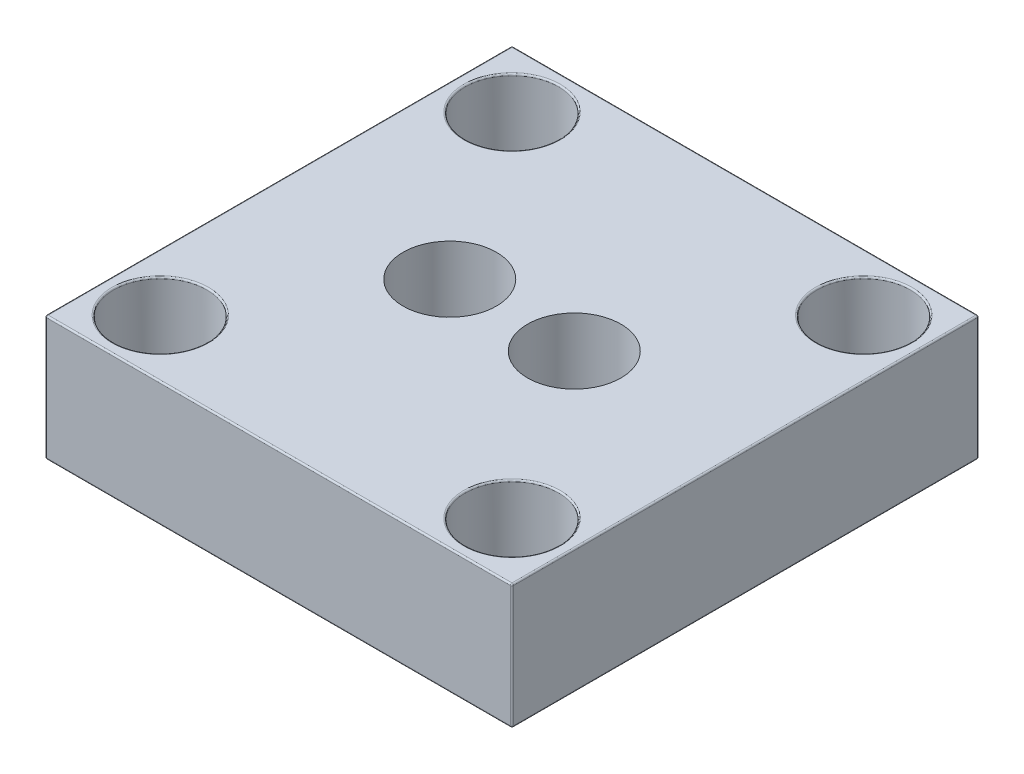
ISO-10303-21;
HEADER;
FILE_DESCRIPTION(('STEP AP214'),'2;1');
FILE_NAME('part.step','',(''),(''),'','','');
FILE_SCHEMA(('AUTOMOTIVE_DESIGN { 1 0 10303 214 1 1 1 1 }'));
ENDSEC;
DATA;
#1=APPLICATION_CONTEXT('core data for automotive mechanical design processes');
#2=APPLICATION_PROTOCOL_DEFINITION('international standard','automotive_design',2000,#1);
#3=PRODUCT_CONTEXT('',#1,'mechanical');
#4=PRODUCT('Part','Part','',(#3));
#5=PRODUCT_RELATED_PRODUCT_CATEGORY('part','',(#4));
#6=PRODUCT_DEFINITION_FORMATION('','',#4);
#7=PRODUCT_DEFINITION_CONTEXT('part definition',#1,'design');
#8=PRODUCT_DEFINITION('design','',#6,#7);
#9=PRODUCT_DEFINITION_SHAPE('','',#8);
#10=(LENGTH_UNIT() NAMED_UNIT(*) SI_UNIT(.MILLI.,.METRE.));
#11=(NAMED_UNIT(*) PLANE_ANGLE_UNIT() SI_UNIT($,.RADIAN.));
#12=(NAMED_UNIT(*) SI_UNIT($,.STERADIAN.) SOLID_ANGLE_UNIT());
#13=UNCERTAINTY_MEASURE_WITH_UNIT(LENGTH_MEASURE(1.E-05),#10,'distance_accuracy_value','');
#14=(GEOMETRIC_REPRESENTATION_CONTEXT(3) GLOBAL_UNCERTAINTY_ASSIGNED_CONTEXT((#13)) GLOBAL_UNIT_ASSIGNED_CONTEXT((#10,
#11,#12)) REPRESENTATION_CONTEXT('',''));
#15=CARTESIAN_POINT('',(0.,0.,0.));
#16=DIRECTION('',(0.,0.,1.));
#17=DIRECTION('',(1.,0.,0.));
#18=AXIS2_PLACEMENT_3D('',#15,#16,#17);
#19=CARTESIAN_POINT('',(47.5,0.,-37.5));
#20=DIRECTION('',(0.,1.,0.));
#21=DIRECTION('',(0.,0.,1.));
#22=AXIS2_PLACEMENT_3D('',#19,#20,#21);
#23=CYLINDRICAL_SURFACE('',#22,4.50000000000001);
#24=CARTESIAN_POINT('',(47.5,0.25,-37.5));
#25=DIRECTION('',(0.,-1.,0.));
#26=DIRECTION('',(0.,0.,-1.));
#27=AXIS2_PLACEMENT_3D('',#24,#25,#26);
#28=CIRCLE('',#27,4.50000000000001);
#29=CARTESIAN_POINT('',(47.5,0.25,-42.));
#30=VERTEX_POINT('',#29);
#31=EDGE_CURVE('E228',#30,#30,#28,.T.);
#32=ORIENTED_EDGE('',*,*,#31,.T.);
#33=EDGE_LOOP('',(#32));
#34=FACE_BOUND('',#33,.T.);
#35=CARTESIAN_POINT('',(47.5,6.,-37.5));
#36=DIRECTION('',(0.,1.,0.));
#37=DIRECTION('',(0.,0.,1.));
#38=AXIS2_PLACEMENT_3D('',#35,#36,#37);
#39=CIRCLE('',#38,4.50000000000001);
#40=CARTESIAN_POINT('',(47.5,6.,-33.));
#41=VERTEX_POINT('',#40);
#42=EDGE_CURVE('E45',#41,#41,#39,.F.);
#43=ORIENTED_EDGE('',*,*,#42,.F.);
#44=EDGE_LOOP('',(#43));
#45=FACE_BOUND('',#44,.T.);
#46=ADVANCED_FACE('F41',(#34,#45),#23,.F.);
#47=CARTESIAN_POINT('',(27.5,0.,-37.5));
#48=DIRECTION('',(0.,1.,0.));
#49=DIRECTION('',(0.,0.,1.));
#50=AXIS2_PLACEMENT_3D('',#47,#48,#49);
#51=CYLINDRICAL_SURFACE('',#50,4.50000000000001);
#52=CARTESIAN_POINT('',(27.5,0.25,-37.5));
#53=DIRECTION('',(0.,-1.,0.));
#54=DIRECTION('',(0.,0.,-1.));
#55=AXIS2_PLACEMENT_3D('',#52,#53,#54);
#56=CIRCLE('',#55,4.50000000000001);
#57=CARTESIAN_POINT('',(27.5,0.25,-42.));
#58=VERTEX_POINT('',#57);
#59=EDGE_CURVE('E212',#58,#58,#56,.T.);
#60=ORIENTED_EDGE('',*,*,#59,.T.);
#61=EDGE_LOOP('',(#60));
#62=FACE_BOUND('',#61,.T.);
#63=CARTESIAN_POINT('',(27.5,6.,-37.5));
#64=DIRECTION('',(0.,1.,0.));
#65=DIRECTION('',(0.,0.,1.));
#66=AXIS2_PLACEMENT_3D('',#63,#64,#65);
#67=CIRCLE('',#66,4.50000000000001);
#68=CARTESIAN_POINT('',(27.5,6.,-33.));
#69=VERTEX_POINT('',#68);
#70=EDGE_CURVE('E327',#69,#69,#67,.F.);
#71=ORIENTED_EDGE('',*,*,#70,.F.);
#72=EDGE_LOOP('',(#71));
#73=FACE_BOUND('',#72,.T.);
#74=ADVANCED_FACE('F453',(#62,#73),#51,.F.);
#75=CARTESIAN_POINT('',(65.75,0.,-9.25));
#76=DIRECTION('',(0.,1.,0.));
#77=DIRECTION('',(0.,0.,1.));
#78=AXIS2_PLACEMENT_3D('',#75,#76,#77);
#79=CYLINDRICAL_SURFACE('',#78,4.5);
#80=CARTESIAN_POINT('',(65.75,0.25,-9.25));
#81=DIRECTION('',(0.,-1.,0.));
#82=DIRECTION('',(0.,0.,-1.));
#83=AXIS2_PLACEMENT_3D('',#80,#81,#82);
#84=CIRCLE('',#83,4.5);
#85=CARTESIAN_POINT('',(65.75,0.25,-13.75));
#86=VERTEX_POINT('',#85);
#87=EDGE_CURVE('E224',#86,#86,#84,.T.);
#88=ORIENTED_EDGE('',*,*,#87,.T.);
#89=EDGE_LOOP('',(#88));
#90=FACE_BOUND('',#89,.T.);
#91=CARTESIAN_POINT('',(65.75,8.,-9.25));
#92=DIRECTION('',(0.,1.,0.));
#93=DIRECTION('',(0.,0.,1.));
#94=AXIS2_PLACEMENT_3D('',#91,#92,#93);
#95=CIRCLE('',#94,4.5);
#96=CARTESIAN_POINT('',(65.75,8.,-4.75));
#97=VERTEX_POINT('',#96);
#98=EDGE_CURVE('E180',#97,#97,#95,.F.);
#99=ORIENTED_EDGE('',*,*,#98,.F.);
#100=EDGE_LOOP('',(#99));
#101=FACE_BOUND('',#100,.T.);
#102=ADVANCED_FACE('F443',(#90,#101),#79,.F.);
#103=CARTESIAN_POINT('',(9.25,0.,-9.25));
#104=DIRECTION('',(0.,1.,0.));
#105=DIRECTION('',(0.,0.,1.));
#106=AXIS2_PLACEMENT_3D('',#103,#104,#105);
#107=CYLINDRICAL_SURFACE('',#106,4.5);
#108=CARTESIAN_POINT('',(9.25,0.25,-9.25));
#109=DIRECTION('',(0.,-1.,0.));
#110=DIRECTION('',(0.,0.,-1.));
#111=AXIS2_PLACEMENT_3D('',#108,#109,#110);
#112=CIRCLE('',#111,4.5);
#113=CARTESIAN_POINT('',(9.25,0.25,-13.75));
#114=VERTEX_POINT('',#113);
#115=EDGE_CURVE('E220',#114,#114,#112,.T.);
#116=ORIENTED_EDGE('',*,*,#115,.T.);
#117=EDGE_LOOP('',(#116));
#118=FACE_BOUND('',#117,.T.);
#119=CARTESIAN_POINT('',(9.25,8.,-9.25));
#120=DIRECTION('',(0.,1.,0.));
#121=DIRECTION('',(0.,0.,1.));
#122=AXIS2_PLACEMENT_3D('',#119,#120,#121);
#123=CIRCLE('',#122,4.5);
#124=CARTESIAN_POINT('',(9.25,8.,-4.75));
#125=VERTEX_POINT('',#124);
#126=EDGE_CURVE('E423',#125,#125,#123,.F.);
#127=ORIENTED_EDGE('',*,*,#126,.F.);
#128=EDGE_LOOP('',(#127));
#129=FACE_BOUND('',#128,.T.);
#130=ADVANCED_FACE('F440',(#118,#129),#107,.F.);
#131=CARTESIAN_POINT('',(9.24999999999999,0.,-65.75));
#132=DIRECTION('',(0.,1.,0.));
#133=DIRECTION('',(0.,0.,1.));
#134=AXIS2_PLACEMENT_3D('',#131,#132,#133);
#135=CYLINDRICAL_SURFACE('',#134,4.50000000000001);
#136=CARTESIAN_POINT('',(9.24999999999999,0.25,-65.75));
#137=DIRECTION('',(0.,-1.,0.));
#138=DIRECTION('',(0.,0.,-1.));
#139=AXIS2_PLACEMENT_3D('',#136,#137,#138);
#140=CIRCLE('',#139,4.50000000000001);
#141=CARTESIAN_POINT('',(9.24999999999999,0.25,-70.25));
#142=VERTEX_POINT('',#141);
#143=EDGE_CURVE('E216',#142,#142,#140,.T.);
#144=ORIENTED_EDGE('',*,*,#143,.T.);
#145=EDGE_LOOP('',(#144));
#146=FACE_BOUND('',#145,.T.);
#147=CARTESIAN_POINT('',(9.24999999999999,8.,-65.75));
#148=DIRECTION('',(0.,1.,0.));
#149=DIRECTION('',(0.,0.,1.));
#150=AXIS2_PLACEMENT_3D('',#147,#148,#149);
#151=CIRCLE('',#150,4.50000000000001);
#152=CARTESIAN_POINT('',(9.24999999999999,8.,-61.25));
#153=VERTEX_POINT('',#152);
#154=EDGE_CURVE('E428',#153,#153,#151,.F.);
#155=ORIENTED_EDGE('',*,*,#154,.F.);
#156=EDGE_LOOP('',(#155));
#157=FACE_BOUND('',#156,.T.);
#158=ADVANCED_FACE('F442',(#146,#157),#135,.F.);
#159=CARTESIAN_POINT('',(65.75,0.,-65.75));
#160=DIRECTION('',(0.,1.,0.));
#161=DIRECTION('',(0.,0.,1.));
#162=AXIS2_PLACEMENT_3D('',#159,#160,#161);
#163=CYLINDRICAL_SURFACE('',#162,4.50000000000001);
#164=CARTESIAN_POINT('',(65.75,0.25,-65.75));
#165=DIRECTION('',(0.,-1.,0.));
#166=DIRECTION('',(0.,0.,-1.));
#167=AXIS2_PLACEMENT_3D('',#164,#165,#166);
#168=CIRCLE('',#167,4.50000000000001);
#169=CARTESIAN_POINT('',(65.75,0.25,-70.25));
#170=VERTEX_POINT('',#169);
#171=EDGE_CURVE('E232',#170,#170,#168,.T.);
#172=ORIENTED_EDGE('',*,*,#171,.T.);
#173=EDGE_LOOP('',(#172));
#174=FACE_BOUND('',#173,.T.);
#175=CARTESIAN_POINT('',(65.75,8.,-65.75));
#176=DIRECTION('',(0.,1.,0.));
#177=DIRECTION('',(0.,0.,1.));
#178=AXIS2_PLACEMENT_3D('',#175,#176,#177);
#179=CIRCLE('',#178,4.50000000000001);
#180=CARTESIAN_POINT('',(65.75,8.,-61.25));
#181=VERTEX_POINT('',#180);
#182=EDGE_CURVE('E171',#181,#181,#179,.F.);
#183=ORIENTED_EDGE('',*,*,#182,.F.);
#184=EDGE_LOOP('',(#183));
#185=FACE_BOUND('',#184,.T.);
#186=ADVANCED_FACE('F450',(#174,#185),#163,.F.);
#187=CARTESIAN_POINT('',(0.,20.,0.));
#188=DIRECTION('',(1.,0.,0.));
#189=DIRECTION('',(0.,0.,-1.));
#190=AXIS2_PLACEMENT_3D('',#187,#188,#189);
#191=PLANE('',#190);
#192=DIRECTION('',(0.,-1.,0.));
#193=VECTOR('',#192,1.);
#194=CARTESIAN_POINT('',(0.,20.,-74.75));
#195=LINE('',#194,#193);
#196=CARTESIAN_POINT('',(0.,19.75,-74.75));
#197=VERTEX_POINT('',#196);
#198=CARTESIAN_POINT('',(0.,0.25,-74.75));
#199=VERTEX_POINT('',#198);
#200=EDGE_CURVE('E242',#197,#199,#195,.T.);
#201=ORIENTED_EDGE('',*,*,#200,.T.);
#202=DIRECTION('',(0.,0.,1.));
#203=VECTOR('',#202,1.);
#204=CARTESIAN_POINT('',(0.,0.25,0.));
#205=LINE('',#204,#203);
#206=CARTESIAN_POINT('',(0.,0.25,-0.25));
#207=VERTEX_POINT('',#206);
#208=EDGE_CURVE('E245',#199,#207,#205,.T.);
#209=ORIENTED_EDGE('',*,*,#208,.T.);
#210=DIRECTION('',(0.,-1.,0.));
#211=VECTOR('',#210,1.);
#212=CARTESIAN_POINT('',(0.,20.,-0.25));
#213=LINE('',#212,#211);
#214=CARTESIAN_POINT('',(0.,19.75,-0.25));
#215=VERTEX_POINT('',#214);
#216=EDGE_CURVE('E239',#207,#215,#213,.F.);
#217=ORIENTED_EDGE('',*,*,#216,.T.);
#218=DIRECTION('',(0.,0.,1.));
#219=VECTOR('',#218,1.);
#220=CARTESIAN_POINT('',(0.,19.75,0.));
#221=LINE('',#220,#219);
#222=EDGE_CURVE('E236',#215,#197,#221,.F.);
#223=ORIENTED_EDGE('',*,*,#222,.T.);
#224=EDGE_LOOP('',(#201,#209,#217,#223));
#225=FACE_BOUND('',#224,.T.);
#226=ADVANCED_FACE('F468',(#225),#191,.F.);
#227=CARTESIAN_POINT('',(0.,20.,0.));
#228=DIRECTION('',(0.,0.,-1.));
#229=DIRECTION('',(-1.,0.,0.));
#230=AXIS2_PLACEMENT_3D('',#227,#228,#229);
#231=PLANE('',#230);
#232=DIRECTION('',(0.,-1.,0.));
#233=VECTOR('',#232,1.);
#234=CARTESIAN_POINT('',(0.25,20.,0.));
#235=LINE('',#234,#233);
#236=CARTESIAN_POINT('',(0.25,19.75,0.));
#237=VERTEX_POINT('',#236);
#238=CARTESIAN_POINT('',(0.25,0.25,0.));
#239=VERTEX_POINT('',#238);
#240=EDGE_CURVE('E279',#237,#239,#235,.T.);
#241=ORIENTED_EDGE('',*,*,#240,.T.);
#242=DIRECTION('',(1.,0.,0.));
#243=VECTOR('',#242,1.);
#244=CARTESIAN_POINT('',(75.,0.25,0.));
#245=LINE('',#244,#243);
#246=CARTESIAN_POINT('',(74.75,0.25,0.));
#247=VERTEX_POINT('',#246);
#248=EDGE_CURVE('E283',#239,#247,#245,.T.);
#249=ORIENTED_EDGE('',*,*,#248,.T.);
#250=DIRECTION('',(0.,-1.,0.));
#251=VECTOR('',#250,1.);
#252=CARTESIAN_POINT('',(74.75,20.,0.));
#253=LINE('',#252,#251);
#254=CARTESIAN_POINT('',(74.75,19.75,0.));
#255=VERTEX_POINT('',#254);
#256=EDGE_CURVE('E276',#247,#255,#253,.F.);
#257=ORIENTED_EDGE('',*,*,#256,.T.);
#258=DIRECTION('',(1.,0.,0.));
#259=VECTOR('',#258,1.);
#260=CARTESIAN_POINT('',(0.,19.75,0.));
#261=LINE('',#260,#259);
#262=EDGE_CURVE('E273',#255,#237,#261,.F.);
#263=ORIENTED_EDGE('',*,*,#262,.T.);
#264=EDGE_LOOP('',(#241,#249,#257,#263));
#265=FACE_BOUND('',#264,.T.);
#266=ADVANCED_FACE('F672',(#265),#231,.F.);
#267=CARTESIAN_POINT('',(75.,20.,0.));
#268=DIRECTION('',(-1.,0.,0.));
#269=DIRECTION('',(0.,0.,1.));
#270=AXIS2_PLACEMENT_3D('',#267,#268,#269);
#271=PLANE('',#270);
#272=DIRECTION('',(0.,0.,-1.));
#273=VECTOR('',#272,1.);
#274=CARTESIAN_POINT('',(75.,0.25,-75.));
#275=LINE('',#274,#273);
#276=CARTESIAN_POINT('',(75.,0.25,-0.25));
#277=VERTEX_POINT('',#276);
#278=CARTESIAN_POINT('',(75.,0.25,-74.75));
#279=VERTEX_POINT('',#278);
#280=EDGE_CURVE('E150',#277,#279,#275,.T.);
#281=ORIENTED_EDGE('',*,*,#280,.T.);
#282=DIRECTION('',(0.,-1.,0.));
#283=VECTOR('',#282,1.);
#284=CARTESIAN_POINT('',(75.,20.,-74.75));
#285=LINE('',#284,#283);
#286=CARTESIAN_POINT('',(75.,19.75,-74.75));
#287=VERTEX_POINT('',#286);
#288=EDGE_CURVE('E269',#279,#287,#285,.F.);
#289=ORIENTED_EDGE('',*,*,#288,.T.);
#290=DIRECTION('',(0.,0.,-1.));
#291=VECTOR('',#290,1.);
#292=CARTESIAN_POINT('',(75.,19.75,0.));
#293=LINE('',#292,#291);
#294=CARTESIAN_POINT('',(75.,19.75,-0.25));
#295=VERTEX_POINT('',#294);
#296=EDGE_CURVE('E261',#287,#295,#293,.F.);
#297=ORIENTED_EDGE('',*,*,#296,.T.);
#298=DIRECTION('',(0.,-1.,0.));
#299=VECTOR('',#298,1.);
#300=CARTESIAN_POINT('',(75.,20.,-0.25));
#301=LINE('',#300,#299);
#302=EDGE_CURVE('E264',#295,#277,#301,.T.);
#303=ORIENTED_EDGE('',*,*,#302,.T.);
#304=EDGE_LOOP('',(#281,#289,#297,#303));
#305=FACE_BOUND('',#304,.T.);
#306=ADVANCED_FACE('F676',(#305),#271,.F.);
#307=CARTESIAN_POINT('',(0.,20.,-75.));
#308=DIRECTION('',(0.,0.,1.));
#309=DIRECTION('',(1.,0.,0.));
#310=AXIS2_PLACEMENT_3D('',#307,#308,#309);
#311=PLANE('',#310);
#312=DIRECTION('',(-1.,0.,0.));
#313=VECTOR('',#312,1.);
#314=CARTESIAN_POINT('',(0.,0.25,-75.));
#315=LINE('',#314,#313);
#316=CARTESIAN_POINT('',(74.75,0.25,-75.));
#317=VERTEX_POINT('',#316);
#318=CARTESIAN_POINT('',(0.25,0.25,-75.));
#319=VERTEX_POINT('',#318);
#320=EDGE_CURVE('E254',#317,#319,#315,.T.);
#321=ORIENTED_EDGE('',*,*,#320,.T.);
#322=DIRECTION('',(0.,-1.,0.));
#323=VECTOR('',#322,1.);
#324=CARTESIAN_POINT('',(0.25,20.,-75.));
#325=LINE('',#324,#323);
#326=CARTESIAN_POINT('',(0.25,19.75,-75.));
#327=VERTEX_POINT('',#326);
#328=EDGE_CURVE('E257',#319,#327,#325,.F.);
#329=ORIENTED_EDGE('',*,*,#328,.T.);
#330=DIRECTION('',(-1.,0.,0.));
#331=VECTOR('',#330,1.);
#332=CARTESIAN_POINT('',(0.,19.75,-75.));
#333=LINE('',#332,#331);
#334=CARTESIAN_POINT('',(74.75,19.75,-75.));
#335=VERTEX_POINT('',#334);
#336=EDGE_CURVE('E249',#327,#335,#333,.F.);
#337=ORIENTED_EDGE('',*,*,#336,.T.);
#338=DIRECTION('',(0.,-1.,0.));
#339=VECTOR('',#338,1.);
#340=CARTESIAN_POINT('',(74.75,20.,-75.));
#341=LINE('',#340,#339);
#342=EDGE_CURVE('E252',#335,#317,#341,.T.);
#343=ORIENTED_EDGE('',*,*,#342,.T.);
#344=EDGE_LOOP('',(#321,#329,#337,#343));
#345=FACE_BOUND('',#344,.T.);
#346=ADVANCED_FACE('F534',(#345),#311,.F.);
#347=CARTESIAN_POINT('',(0.,20.,-75.));
#348=DIRECTION('',(0.,-1.,0.));
#349=DIRECTION('',(0.,0.,-1.));
#350=AXIS2_PLACEMENT_3D('',#347,#348,#349);
#351=PLANE('',#350);
#352=CARTESIAN_POINT('',(47.5,20.,-37.5));
#353=DIRECTION('',(0.,1.,0.));
#354=DIRECTION('',(0.,0.,1.));
#355=AXIS2_PLACEMENT_3D('',#352,#353,#354);
#356=CIRCLE('',#355,7.5);
#357=CARTESIAN_POINT('',(47.5,20.,-30.));
#358=VERTEX_POINT('',#357);
#359=EDGE_CURVE('E413',#358,#358,#356,.T.);
#360=ORIENTED_EDGE('',*,*,#359,.F.);
#361=EDGE_LOOP('',(#360));
#362=FACE_BOUND('',#361,.T.);
#363=CARTESIAN_POINT('',(27.5,20.,-37.5));
#364=DIRECTION('',(0.,1.,0.));
#365=DIRECTION('',(0.,0.,1.));
#366=AXIS2_PLACEMENT_3D('',#363,#364,#365);
#367=CIRCLE('',#366,7.5);
#368=CARTESIAN_POINT('',(27.5,20.,-30.));
#369=VERTEX_POINT('',#368);
#370=EDGE_CURVE('E405',#369,#369,#367,.T.);
#371=ORIENTED_EDGE('',*,*,#370,.F.);
#372=EDGE_LOOP('',(#371));
#373=FACE_BOUND('',#372,.T.);
#374=DIRECTION('',(0.,0.,-1.));
#375=VECTOR('',#374,1.);
#376=CARTESIAN_POINT('',(74.75,20.,-75.));
#377=LINE('',#376,#375);
#378=CARTESIAN_POINT('',(74.75,20.,-0.25));
#379=VERTEX_POINT('',#378);
#380=CARTESIAN_POINT('',(74.75,20.,-74.75));
#381=VERTEX_POINT('',#380);
#382=EDGE_CURVE('E59',#379,#381,#377,.T.);
#383=ORIENTED_EDGE('',*,*,#382,.T.);
#384=DIRECTION('',(-1.,0.,0.));
#385=VECTOR('',#384,1.);
#386=CARTESIAN_POINT('',(0.,20.,-74.75));
#387=LINE('',#386,#385);
#388=CARTESIAN_POINT('',(0.25,20.,-74.75));
#389=VERTEX_POINT('',#388);
#390=EDGE_CURVE('E309',#381,#389,#387,.T.);
#391=ORIENTED_EDGE('',*,*,#390,.T.);
#392=DIRECTION('',(0.,0.,1.));
#393=VECTOR('',#392,1.);
#394=CARTESIAN_POINT('',(0.25,20.,-75.));
#395=LINE('',#394,#393);
#396=CARTESIAN_POINT('',(0.25,20.,-0.25));
#397=VERTEX_POINT('',#396);
#398=EDGE_CURVE('E302',#389,#397,#395,.T.);
#399=ORIENTED_EDGE('',*,*,#398,.T.);
#400=DIRECTION('',(1.,0.,0.));
#401=VECTOR('',#400,1.);
#402=CARTESIAN_POINT('',(0.,20.,-0.25));
#403=LINE('',#402,#401);
#404=EDGE_CURVE('E64',#397,#379,#403,.T.);
#405=ORIENTED_EDGE('',*,*,#404,.T.);
#406=EDGE_LOOP('',(#383,#391,#399,#405));
#407=FACE_BOUND('',#406,.T.);
#408=CARTESIAN_POINT('',(65.75,20.,-65.75));
#409=DIRECTION('',(0.,-1.,0.));
#410=DIRECTION('',(0.,0.,-1.));
#411=AXIS2_PLACEMENT_3D('',#408,#409,#410);
#412=CIRCLE('',#411,7.75000000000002);
#413=CARTESIAN_POINT('',(65.75,20.,-73.5));
#414=VERTEX_POINT('',#413);
#415=EDGE_CURVE('E298',#414,#414,#412,.T.);
#416=ORIENTED_EDGE('',*,*,#415,.T.);
#417=EDGE_LOOP('',(#416));
#418=FACE_BOUND('',#417,.T.);
#419=CARTESIAN_POINT('',(9.24999999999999,20.,-65.75));
#420=DIRECTION('',(0.,-1.,0.));
#421=DIRECTION('',(0.,0.,-1.));
#422=AXIS2_PLACEMENT_3D('',#419,#420,#421);
#423=CIRCLE('',#422,7.75);
#424=CARTESIAN_POINT('',(9.24999999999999,20.,-73.5));
#425=VERTEX_POINT('',#424);
#426=EDGE_CURVE('E294',#425,#425,#423,.T.);
#427=ORIENTED_EDGE('',*,*,#426,.T.);
#428=EDGE_LOOP('',(#427));
#429=FACE_BOUND('',#428,.T.);
#430=CARTESIAN_POINT('',(9.25,20.,-9.25));
#431=DIRECTION('',(0.,-1.,0.));
#432=DIRECTION('',(0.,0.,-1.));
#433=AXIS2_PLACEMENT_3D('',#430,#431,#432);
#434=CIRCLE('',#433,7.75);
#435=CARTESIAN_POINT('',(9.25,20.,-17.));
#436=VERTEX_POINT('',#435);
#437=EDGE_CURVE('E290',#436,#436,#434,.T.);
#438=ORIENTED_EDGE('',*,*,#437,.T.);
#439=EDGE_LOOP('',(#438));
#440=FACE_BOUND('',#439,.T.);
#441=CARTESIAN_POINT('',(65.75,20.,-9.25));
#442=DIRECTION('',(0.,-1.,0.));
#443=DIRECTION('',(0.,0.,-1.));
#444=AXIS2_PLACEMENT_3D('',#441,#442,#443);
#445=CIRCLE('',#444,7.75000000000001);
#446=CARTESIAN_POINT('',(65.75,20.,-17.));
#447=VERTEX_POINT('',#446);
#448=EDGE_CURVE('E286',#447,#447,#445,.T.);
#449=ORIENTED_EDGE('',*,*,#448,.T.);
#450=EDGE_LOOP('',(#449));
#451=FACE_BOUND('',#450,.T.);
#452=ADVANCED_FACE('F531',(#362,#373,#407,#418,#429,#440,#451),#351,.F.);
#453=CARTESIAN_POINT('',(0.,0.,-75.));
#454=DIRECTION('',(0.,-1.,0.));
#455=DIRECTION('',(0.,0.,-1.));
#456=AXIS2_PLACEMENT_3D('',#453,#454,#455);
#457=PLANE('',#456);
#458=CARTESIAN_POINT('',(27.5,0.,-37.5));
#459=DIRECTION('',(0.,-1.,0.));
#460=DIRECTION('',(0.,0.,-1.));
#461=AXIS2_PLACEMENT_3D('',#458,#459,#460);
#462=CIRCLE('',#461,4.75000000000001);
#463=CARTESIAN_POINT('',(27.5,0.,-42.25));
#464=VERTEX_POINT('',#463);
#465=EDGE_CURVE('E208',#464,#464,#462,.F.);
#466=ORIENTED_EDGE('',*,*,#465,.T.);
#467=EDGE_LOOP('',(#466));
#468=FACE_BOUND('',#467,.T.);
#469=CARTESIAN_POINT('',(9.24999999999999,0.,-65.75));
#470=DIRECTION('',(0.,-1.,0.));
#471=DIRECTION('',(0.,0.,-1.));
#472=AXIS2_PLACEMENT_3D('',#469,#470,#471);
#473=CIRCLE('',#472,4.75000000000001);
#474=CARTESIAN_POINT('',(9.24999999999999,0.,-70.5));
#475=VERTEX_POINT('',#474);
#476=EDGE_CURVE('E204',#475,#475,#473,.F.);
#477=ORIENTED_EDGE('',*,*,#476,.T.);
#478=EDGE_LOOP('',(#477));
#479=FACE_BOUND('',#478,.T.);
#480=CARTESIAN_POINT('',(9.25,0.,-9.25));
#481=DIRECTION('',(0.,-1.,0.));
#482=DIRECTION('',(0.,0.,-1.));
#483=AXIS2_PLACEMENT_3D('',#480,#481,#482);
#484=CIRCLE('',#483,4.75);
#485=CARTESIAN_POINT('',(9.25,0.,-14.));
#486=VERTEX_POINT('',#485);
#487=EDGE_CURVE('E200',#486,#486,#484,.F.);
#488=ORIENTED_EDGE('',*,*,#487,.T.);
#489=EDGE_LOOP('',(#488));
#490=FACE_BOUND('',#489,.T.);
#491=CARTESIAN_POINT('',(65.75,0.,-9.25));
#492=DIRECTION('',(0.,-1.,0.));
#493=DIRECTION('',(0.,0.,-1.));
#494=AXIS2_PLACEMENT_3D('',#491,#492,#493);
#495=CIRCLE('',#494,4.75000000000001);
#496=CARTESIAN_POINT('',(65.75,0.,-14.));
#497=VERTEX_POINT('',#496);
#498=EDGE_CURVE('E196',#497,#497,#495,.F.);
#499=ORIENTED_EDGE('',*,*,#498,.T.);
#500=EDGE_LOOP('',(#499));
#501=FACE_BOUND('',#500,.T.);
#502=CARTESIAN_POINT('',(47.5,0.,-37.5));
#503=DIRECTION('',(0.,-1.,0.));
#504=DIRECTION('',(0.,0.,-1.));
#505=AXIS2_PLACEMENT_3D('',#502,#503,#504);
#506=CIRCLE('',#505,4.75000000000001);
#507=CARTESIAN_POINT('',(47.5,0.,-42.25));
#508=VERTEX_POINT('',#507);
#509=EDGE_CURVE('E192',#508,#508,#506,.F.);
#510=ORIENTED_EDGE('',*,*,#509,.T.);
#511=EDGE_LOOP('',(#510));
#512=FACE_BOUND('',#511,.T.);
#513=CARTESIAN_POINT('',(65.75,0.,-65.75));
#514=DIRECTION('',(0.,-1.,0.));
#515=DIRECTION('',(0.,0.,-1.));
#516=AXIS2_PLACEMENT_3D('',#513,#514,#515);
#517=CIRCLE('',#516,4.75000000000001);
#518=CARTESIAN_POINT('',(65.75,0.,-70.5));
#519=VERTEX_POINT('',#518);
#520=EDGE_CURVE('E188',#519,#519,#517,.F.);
#521=ORIENTED_EDGE('',*,*,#520,.T.);
#522=EDGE_LOOP('',(#521));
#523=FACE_BOUND('',#522,.T.);
#524=DIRECTION('',(1.,0.,0.));
#525=VECTOR('',#524,1.);
#526=CARTESIAN_POINT('',(0.,0.,-0.25));
#527=LINE('',#526,#525);
#528=CARTESIAN_POINT('',(74.75,0.,-0.25));
#529=VERTEX_POINT('',#528);
#530=CARTESIAN_POINT('',(0.25,0.,-0.25));
#531=VERTEX_POINT('',#530);
#532=EDGE_CURVE('E136',#529,#531,#527,.F.);
#533=ORIENTED_EDGE('',*,*,#532,.T.);
#534=DIRECTION('',(0.,0.,1.));
#535=VECTOR('',#534,1.);
#536=CARTESIAN_POINT('',(0.25,0.,-75.));
#537=LINE('',#536,#535);
#538=CARTESIAN_POINT('',(0.25,0.,-74.75));
#539=VERTEX_POINT('',#538);
#540=EDGE_CURVE('E185',#531,#539,#537,.F.);
#541=ORIENTED_EDGE('',*,*,#540,.T.);
#542=DIRECTION('',(-1.,0.,0.));
#543=VECTOR('',#542,1.);
#544=CARTESIAN_POINT('',(75.,0.,-74.75));
#545=LINE('',#544,#543);
#546=CARTESIAN_POINT('',(74.75,0.,-74.75));
#547=VERTEX_POINT('',#546);
#548=EDGE_CURVE('E139',#539,#547,#545,.F.);
#549=ORIENTED_EDGE('',*,*,#548,.T.);
#550=DIRECTION('',(0.,0.,-1.));
#551=VECTOR('',#550,1.);
#552=CARTESIAN_POINT('',(74.75,0.,0.));
#553=LINE('',#552,#551);
#554=EDGE_CURVE('E131',#547,#529,#553,.F.);
#555=ORIENTED_EDGE('',*,*,#554,.T.);
#556=EDGE_LOOP('',(#533,#541,#549,#555));
#557=FACE_BOUND('',#556,.T.);
#558=ADVANCED_FACE('F133',(#468,#479,#490,#501,#512,#523,#557),#457,.T.);
#559=CARTESIAN_POINT('',(65.75,8.,-65.75));
#560=DIRECTION('',(0.,1.,0.));
#561=DIRECTION('',(0.,0.,1.));
#562=AXIS2_PLACEMENT_3D('',#559,#560,#561);
#563=PLANE('',#562);
#564=CARTESIAN_POINT('',(65.75,8.,-65.75));
#565=DIRECTION('',(0.,1.,0.));
#566=DIRECTION('',(0.,0.,1.));
#567=AXIS2_PLACEMENT_3D('',#564,#565,#566);
#568=CIRCLE('',#567,7.50000000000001);
#569=CARTESIAN_POINT('',(65.75,8.,-58.25));
#570=VERTEX_POINT('',#569);
#571=EDGE_CURVE('E177',#570,#570,#568,.T.);
#572=ORIENTED_EDGE('',*,*,#571,.T.);
#573=EDGE_LOOP('',(#572));
#574=FACE_BOUND('',#573,.T.);
#575=ORIENTED_EDGE('',*,*,#182,.T.);
#576=EDGE_LOOP('',(#575));
#577=FACE_BOUND('',#576,.T.);
#578=ADVANCED_FACE('F474',(#574,#577),#563,.T.);
#579=CARTESIAN_POINT('',(65.75,8.,-65.75));
#580=DIRECTION('',(0.,1.,0.));
#581=DIRECTION('',(0.,0.,1.));
#582=AXIS2_PLACEMENT_3D('',#579,#580,#581);
#583=CYLINDRICAL_SURFACE('',#582,7.50000000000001);
#584=CARTESIAN_POINT('',(65.75,19.75,-65.75));
#585=DIRECTION('',(0.,-1.,0.));
#586=DIRECTION('',(0.,0.,-1.));
#587=AXIS2_PLACEMENT_3D('',#584,#585,#586);
#588=CIRCLE('',#587,7.50000000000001);
#589=CARTESIAN_POINT('',(65.75,19.75,-73.25));
#590=VERTEX_POINT('',#589);
#591=EDGE_CURVE('E312',#590,#590,#588,.F.);
#592=ORIENTED_EDGE('',*,*,#591,.T.);
#593=EDGE_LOOP('',(#592));
#594=FACE_BOUND('',#593,.T.);
#595=ORIENTED_EDGE('',*,*,#571,.F.);
#596=EDGE_LOOP('',(#595));
#597=FACE_BOUND('',#596,.T.);
#598=ADVANCED_FACE('F470',(#594,#597),#583,.F.);
#599=CARTESIAN_POINT('',(9.24999999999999,8.,-65.75));
#600=DIRECTION('',(0.,1.,0.));
#601=DIRECTION('',(0.,0.,1.));
#602=AXIS2_PLACEMENT_3D('',#599,#600,#601);
#603=PLANE('',#602);
#604=CARTESIAN_POINT('',(9.24999999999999,8.,-65.75));
#605=DIRECTION('',(0.,1.,0.));
#606=DIRECTION('',(0.,0.,1.));
#607=AXIS2_PLACEMENT_3D('',#604,#605,#606);
#608=CIRCLE('',#607,7.5);
#609=CARTESIAN_POINT('',(9.24999999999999,8.,-58.25));
#610=VERTEX_POINT('',#609);
#611=EDGE_CURVE('E424',#610,#610,#608,.T.);
#612=ORIENTED_EDGE('',*,*,#611,.T.);
#613=EDGE_LOOP('',(#612));
#614=FACE_BOUND('',#613,.T.);
#615=ORIENTED_EDGE('',*,*,#154,.T.);
#616=EDGE_LOOP('',(#615));
#617=FACE_BOUND('',#616,.T.);
#618=ADVANCED_FACE('F473',(#614,#617),#603,.T.);
#619=CARTESIAN_POINT('',(9.24999999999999,8.,-65.75));
#620=DIRECTION('',(0.,1.,0.));
#621=DIRECTION('',(0.,0.,1.));
#622=AXIS2_PLACEMENT_3D('',#619,#620,#621);
#623=CYLINDRICAL_SURFACE('',#622,7.5);
#624=CARTESIAN_POINT('',(9.24999999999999,19.75,-65.75));
#625=DIRECTION('',(0.,-1.,0.));
#626=DIRECTION('',(0.,0.,-1.));
#627=AXIS2_PLACEMENT_3D('',#624,#625,#626);
#628=CIRCLE('',#627,7.5);
#629=CARTESIAN_POINT('',(9.24999999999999,19.75,-73.25));
#630=VERTEX_POINT('',#629);
#631=EDGE_CURVE('E316',#630,#630,#628,.F.);
#632=ORIENTED_EDGE('',*,*,#631,.T.);
#633=EDGE_LOOP('',(#632));
#634=FACE_BOUND('',#633,.T.);
#635=ORIENTED_EDGE('',*,*,#611,.F.);
#636=EDGE_LOOP('',(#635));
#637=FACE_BOUND('',#636,.T.);
#638=ADVANCED_FACE('F479',(#634,#637),#623,.F.);
#639=CARTESIAN_POINT('',(9.25,8.,-9.25));
#640=DIRECTION('',(0.,1.,0.));
#641=DIRECTION('',(0.,0.,1.));
#642=AXIS2_PLACEMENT_3D('',#639,#640,#641);
#643=PLANE('',#642);
#644=CARTESIAN_POINT('',(9.25,8.,-9.25));
#645=DIRECTION('',(0.,1.,0.));
#646=DIRECTION('',(0.,0.,1.));
#647=AXIS2_PLACEMENT_3D('',#644,#645,#646);
#648=CIRCLE('',#647,7.5);
#649=CARTESIAN_POINT('',(9.25,8.,-1.75));
#650=VERTEX_POINT('',#649);
#651=EDGE_CURVE('E419',#650,#650,#648,.T.);
#652=ORIENTED_EDGE('',*,*,#651,.T.);
#653=EDGE_LOOP('',(#652));
#654=FACE_BOUND('',#653,.T.);
#655=ORIENTED_EDGE('',*,*,#126,.T.);
#656=EDGE_LOOP('',(#655));
#657=FACE_BOUND('',#656,.T.);
#658=ADVANCED_FACE('F438',(#654,#657),#643,.T.);
#659=CARTESIAN_POINT('',(9.25,8.,-9.25));
#660=DIRECTION('',(0.,1.,0.));
#661=DIRECTION('',(0.,0.,1.));
#662=AXIS2_PLACEMENT_3D('',#659,#660,#661);
#663=CYLINDRICAL_SURFACE('',#662,7.5);
#664=CARTESIAN_POINT('',(9.25,19.75,-9.25));
#665=DIRECTION('',(0.,-1.,0.));
#666=DIRECTION('',(0.,0.,-1.));
#667=AXIS2_PLACEMENT_3D('',#664,#665,#666);
#668=CIRCLE('',#667,7.5);
#669=CARTESIAN_POINT('',(9.25,19.75,-16.75));
#670=VERTEX_POINT('',#669);
#671=EDGE_CURVE('E51',#670,#670,#668,.F.);
#672=ORIENTED_EDGE('',*,*,#671,.T.);
#673=EDGE_LOOP('',(#672));
#674=FACE_BOUND('',#673,.T.);
#675=ORIENTED_EDGE('',*,*,#651,.F.);
#676=EDGE_LOOP('',(#675));
#677=FACE_BOUND('',#676,.T.);
#678=ADVANCED_FACE('F486',(#674,#677),#663,.F.);
#679=CARTESIAN_POINT('',(65.75,8.,-9.25));
#680=DIRECTION('',(0.,1.,0.));
#681=DIRECTION('',(0.,0.,1.));
#682=AXIS2_PLACEMENT_3D('',#679,#680,#681);
#683=PLANE('',#682);
#684=CARTESIAN_POINT('',(65.75,8.,-9.25));
#685=DIRECTION('',(0.,1.,0.));
#686=DIRECTION('',(0.,0.,1.));
#687=AXIS2_PLACEMENT_3D('',#684,#685,#686);
#688=CIRCLE('',#687,7.50000000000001);
#689=CARTESIAN_POINT('',(65.75,8.,-1.74999999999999));
#690=VERTEX_POINT('',#689);
#691=EDGE_CURVE('E397',#690,#690,#688,.T.);
#692=ORIENTED_EDGE('',*,*,#691,.T.);
#693=EDGE_LOOP('',(#692));
#694=FACE_BOUND('',#693,.T.);
#695=ORIENTED_EDGE('',*,*,#98,.T.);
#696=EDGE_LOOP('',(#695));
#697=FACE_BOUND('',#696,.T.);
#698=ADVANCED_FACE('F489',(#694,#697),#683,.T.);
#699=CARTESIAN_POINT('',(65.75,8.,-9.25));
#700=DIRECTION('',(0.,1.,0.));
#701=DIRECTION('',(0.,0.,1.));
#702=AXIS2_PLACEMENT_3D('',#699,#700,#701);
#703=CYLINDRICAL_SURFACE('',#702,7.50000000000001);
#704=CARTESIAN_POINT('',(65.75,19.75,-9.25));
#705=DIRECTION('',(0.,-1.,0.));
#706=DIRECTION('',(0.,0.,-1.));
#707=AXIS2_PLACEMENT_3D('',#704,#705,#706);
#708=CIRCLE('',#707,7.50000000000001);
#709=CARTESIAN_POINT('',(65.75,19.75,-16.75));
#710=VERTEX_POINT('',#709);
#711=EDGE_CURVE('E11',#710,#710,#708,.F.);
#712=ORIENTED_EDGE('',*,*,#711,.T.);
#713=EDGE_LOOP('',(#712));
#714=FACE_BOUND('',#713,.T.);
#715=ORIENTED_EDGE('',*,*,#691,.F.);
#716=EDGE_LOOP('',(#715));
#717=FACE_BOUND('',#716,.T.);
#718=ADVANCED_FACE('F494',(#714,#717),#703,.F.);
#719=CARTESIAN_POINT('',(27.5,0.25,-37.5));
#720=DIRECTION('',(0.,-1.,0.));
#721=DIRECTION('',(0.,0.,-1.));
#722=AXIS2_PLACEMENT_3D('',#719,#720,#721);
#723=TOROIDAL_SURFACE('',#722,4.75000000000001,0.25);
#724=ORIENTED_EDGE('',*,*,#59,.F.);
#725=EDGE_LOOP('',(#724));
#726=FACE_BOUND('',#725,.T.);
#727=ORIENTED_EDGE('',*,*,#465,.F.);
#728=EDGE_LOOP('',(#727));
#729=FACE_BOUND('',#728,.T.);
#730=ADVANCED_FACE('F497',(#726,#729),#723,.T.);
#731=CARTESIAN_POINT('',(9.24999999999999,0.25,-65.75));
#732=DIRECTION('',(0.,-1.,0.));
#733=DIRECTION('',(0.,0.,-1.));
#734=AXIS2_PLACEMENT_3D('',#731,#732,#733);
#735=TOROIDAL_SURFACE('',#734,4.75000000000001,0.25);
#736=ORIENTED_EDGE('',*,*,#143,.F.);
#737=EDGE_LOOP('',(#736));
#738=FACE_BOUND('',#737,.T.);
#739=ORIENTED_EDGE('',*,*,#476,.F.);
#740=EDGE_LOOP('',(#739));
#741=FACE_BOUND('',#740,.T.);
#742=ADVANCED_FACE('F662',(#738,#741),#735,.T.);
#743=CARTESIAN_POINT('',(9.25,0.25,-9.25));
#744=DIRECTION('',(0.,-1.,0.));
#745=DIRECTION('',(0.,0.,-1.));
#746=AXIS2_PLACEMENT_3D('',#743,#744,#745);
#747=TOROIDAL_SURFACE('',#746,4.75,0.25);
#748=ORIENTED_EDGE('',*,*,#115,.F.);
#749=EDGE_LOOP('',(#748));
#750=FACE_BOUND('',#749,.T.);
#751=ORIENTED_EDGE('',*,*,#487,.F.);
#752=EDGE_LOOP('',(#751));
#753=FACE_BOUND('',#752,.T.);
#754=ADVANCED_FACE('F658',(#750,#753),#747,.T.);
#755=CARTESIAN_POINT('',(65.75,0.25,-9.25));
#756=DIRECTION('',(0.,-1.,0.));
#757=DIRECTION('',(0.,0.,-1.));
#758=AXIS2_PLACEMENT_3D('',#755,#756,#757);
#759=TOROIDAL_SURFACE('',#758,4.75000000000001,0.25);
#760=ORIENTED_EDGE('',*,*,#87,.F.);
#761=EDGE_LOOP('',(#760));
#762=FACE_BOUND('',#761,.T.);
#763=ORIENTED_EDGE('',*,*,#498,.F.);
#764=EDGE_LOOP('',(#763));
#765=FACE_BOUND('',#764,.T.);
#766=ADVANCED_FACE('F654',(#762,#765),#759,.T.);
#767=CARTESIAN_POINT('',(47.5,0.25,-37.5));
#768=DIRECTION('',(0.,-1.,0.));
#769=DIRECTION('',(0.,0.,-1.));
#770=AXIS2_PLACEMENT_3D('',#767,#768,#769);
#771=TOROIDAL_SURFACE('',#770,4.75000000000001,0.25);
#772=ORIENTED_EDGE('',*,*,#31,.F.);
#773=EDGE_LOOP('',(#772));
#774=FACE_BOUND('',#773,.T.);
#775=ORIENTED_EDGE('',*,*,#509,.F.);
#776=EDGE_LOOP('',(#775));
#777=FACE_BOUND('',#776,.T.);
#778=ADVANCED_FACE('F650',(#774,#777),#771,.T.);
#779=CARTESIAN_POINT('',(65.75,0.25,-65.75));
#780=DIRECTION('',(0.,-1.,0.));
#781=DIRECTION('',(0.,0.,-1.));
#782=AXIS2_PLACEMENT_3D('',#779,#780,#781);
#783=TOROIDAL_SURFACE('',#782,4.75000000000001,0.25);
#784=ORIENTED_EDGE('',*,*,#171,.F.);
#785=EDGE_LOOP('',(#784));
#786=FACE_BOUND('',#785,.T.);
#787=ORIENTED_EDGE('',*,*,#520,.F.);
#788=EDGE_LOOP('',(#787));
#789=FACE_BOUND('',#788,.T.);
#790=ADVANCED_FACE('F578',(#786,#789),#783,.T.);
#791=CARTESIAN_POINT('',(74.75,19.75,-75.));
#792=DIRECTION('',(0.,0.,-1.));
#793=DIRECTION('',(-1.,0.,0.));
#794=AXIS2_PLACEMENT_3D('',#791,#792,#793);
#795=CYLINDRICAL_SURFACE('',#794,0.25);
#796=CARTESIAN_POINT('',(74.75,19.75,-74.75));
#797=DIRECTION('',(0.,0.,-1.));
#798=DIRECTION('',(-1.,0.,0.));
#799=AXIS2_PLACEMENT_3D('',#796,#797,#798);
#800=CIRCLE('',#799,0.25);
#801=EDGE_CURVE('E394',#381,#287,#800,.T.);
#802=ORIENTED_EDGE('',*,*,#801,.F.);
#803=ORIENTED_EDGE('',*,*,#382,.F.);
#804=CARTESIAN_POINT('',(74.75,19.75,-0.25));
#805=DIRECTION('',(0.,0.,1.));
#806=DIRECTION('',(0.,-1.,0.));
#807=AXIS2_PLACEMENT_3D('',#804,#805,#806);
#808=CIRCLE('',#807,0.25);
#809=EDGE_CURVE('E390',#295,#379,#808,.T.);
#810=ORIENTED_EDGE('',*,*,#809,.F.);
#811=ORIENTED_EDGE('',*,*,#296,.F.);
#812=EDGE_LOOP('',(#802,#803,#810,#811));
#813=FACE_BOUND('',#812,.T.);
#814=ADVANCED_FACE('F574',(#813),#795,.T.);
#815=CARTESIAN_POINT('',(74.75,19.75,-74.75));
#816=DIRECTION('',(0.,0.,1.));
#817=DIRECTION('',(1.,0.,0.));
#818=AXIS2_PLACEMENT_3D('',#815,#816,#817);
#819=SPHERICAL_SURFACE('',#818,0.25);
#820=CARTESIAN_POINT('',(74.75,19.75,-74.75));
#821=DIRECTION('',(1.,0.,0.));
#822=DIRECTION('',(0.,0.,-1.));
#823=AXIS2_PLACEMENT_3D('',#820,#821,#822);
#824=CIRCLE('',#823,0.25);
#825=EDGE_CURVE('E383',#381,#335,#824,.F.);
#826=ORIENTED_EDGE('',*,*,#825,.F.);
#827=ORIENTED_EDGE('',*,*,#801,.T.);
#828=CARTESIAN_POINT('',(74.75,19.75,-74.75));
#829=DIRECTION('',(0.,1.,0.));
#830=DIRECTION('',(0.,0.,1.));
#831=AXIS2_PLACEMENT_3D('',#828,#829,#830);
#832=CIRCLE('',#831,0.25);
#833=EDGE_CURVE('E387',#335,#287,#832,.F.);
#834=ORIENTED_EDGE('',*,*,#833,.F.);
#835=EDGE_LOOP('',(#826,#827,#834));
#836=FACE_BOUND('',#835,.T.);
#837=ADVANCED_FACE('F577',(#836),#819,.T.);
#838=CARTESIAN_POINT('',(74.75,19.75,-0.25));
#839=DIRECTION('',(0.,0.,1.));
#840=DIRECTION('',(1.,0.,0.));
#841=AXIS2_PLACEMENT_3D('',#838,#839,#840);
#842=SPHERICAL_SURFACE('',#841,0.25);
#843=CARTESIAN_POINT('',(74.75,19.75,-0.25));
#844=DIRECTION('',(0.,1.,0.));
#845=DIRECTION('',(0.,0.,1.));
#846=AXIS2_PLACEMENT_3D('',#843,#844,#845);
#847=CIRCLE('',#846,0.25);
#848=EDGE_CURVE('E375',#295,#255,#847,.F.);
#849=ORIENTED_EDGE('',*,*,#848,.F.);
#850=ORIENTED_EDGE('',*,*,#809,.T.);
#851=CARTESIAN_POINT('',(74.75,19.75,-0.25));
#852=DIRECTION('',(1.,0.,0.));
#853=DIRECTION('',(0.,0.,-1.));
#854=AXIS2_PLACEMENT_3D('',#851,#852,#853);
#855=CIRCLE('',#854,0.25);
#856=EDGE_CURVE('E379',#255,#379,#855,.F.);
#857=ORIENTED_EDGE('',*,*,#856,.F.);
#858=EDGE_LOOP('',(#849,#850,#857));
#859=FACE_BOUND('',#858,.T.);
#860=ADVANCED_FACE('F582',(#859),#842,.T.);
#861=CARTESIAN_POINT('',(74.75,20.,-74.75));
#862=DIRECTION('',(0.,-1.,0.));
#863=DIRECTION('',(0.,0.,-1.));
#864=AXIS2_PLACEMENT_3D('',#861,#862,#863);
#865=CYLINDRICAL_SURFACE('',#864,0.25);
#866=ORIENTED_EDGE('',*,*,#833,.T.);
#867=ORIENTED_EDGE('',*,*,#288,.F.);
#868=CARTESIAN_POINT('',(74.75,0.25,-74.75));
#869=DIRECTION('',(0.,-1.,0.));
#870=DIRECTION('',(0.,0.,-1.));
#871=AXIS2_PLACEMENT_3D('',#868,#869,#870);
#872=CIRCLE('',#871,0.25);
#873=EDGE_CURVE('E368',#317,#279,#872,.T.);
#874=ORIENTED_EDGE('',*,*,#873,.F.);
#875=ORIENTED_EDGE('',*,*,#342,.F.);
#876=EDGE_LOOP('',(#866,#867,#874,#875));
#877=FACE_BOUND('',#876,.T.);
#878=ADVANCED_FACE('F586',(#877),#865,.T.);
#879=CARTESIAN_POINT('',(0.,19.75,-74.75));
#880=DIRECTION('',(-1.,0.,0.));
#881=DIRECTION('',(0.,0.,1.));
#882=AXIS2_PLACEMENT_3D('',#879,#880,#881);
#883=CYLINDRICAL_SURFACE('',#882,0.25);
#884=ORIENTED_EDGE('',*,*,#825,.T.);
#885=ORIENTED_EDGE('',*,*,#336,.F.);
#886=CARTESIAN_POINT('',(0.25,19.75,-74.75));
#887=DIRECTION('',(-1.,0.,0.));
#888=DIRECTION('',(0.,0.,1.));
#889=AXIS2_PLACEMENT_3D('',#886,#887,#888);
#890=CIRCLE('',#889,0.25);
#891=EDGE_CURVE('E364',#389,#327,#890,.T.);
#892=ORIENTED_EDGE('',*,*,#891,.F.);
#893=ORIENTED_EDGE('',*,*,#390,.F.);
#894=EDGE_LOOP('',(#884,#885,#892,#893));
#895=FACE_BOUND('',#894,.T.);
#896=ADVANCED_FACE('F590',(#895),#883,.T.);
#897=CARTESIAN_POINT('',(0.25,19.75,-75.));
#898=DIRECTION('',(0.,0.,1.));
#899=DIRECTION('',(1.,0.,0.));
#900=AXIS2_PLACEMENT_3D('',#897,#898,#899);
#901=CYLINDRICAL_SURFACE('',#900,0.25);
#902=CARTESIAN_POINT('',(0.25,19.75,-0.25));
#903=DIRECTION('',(0.,0.,1.));
#904=DIRECTION('',(1.,0.,0.));
#905=AXIS2_PLACEMENT_3D('',#902,#903,#904);
#906=CIRCLE('',#905,0.25);
#907=EDGE_CURVE('E357',#397,#215,#906,.T.);
#908=ORIENTED_EDGE('',*,*,#907,.F.);
#909=ORIENTED_EDGE('',*,*,#398,.F.);
#910=CARTESIAN_POINT('',(0.25,19.75,-74.75));
#911=DIRECTION('',(0.,0.,-1.));
#912=DIRECTION('',(-1.,0.,0.));
#913=AXIS2_PLACEMENT_3D('',#910,#911,#912);
#914=CIRCLE('',#913,0.25);
#915=EDGE_CURVE('E361',#197,#389,#914,.T.);
#916=ORIENTED_EDGE('',*,*,#915,.F.);
#917=ORIENTED_EDGE('',*,*,#222,.F.);
#918=EDGE_LOOP('',(#908,#909,#916,#917));
#919=FACE_BOUND('',#918,.T.);
#920=ADVANCED_FACE('F594',(#919),#901,.T.);
#921=CARTESIAN_POINT('',(0.,19.75,-0.25));
#922=DIRECTION('',(1.,0.,0.));
#923=DIRECTION('',(0.,0.,-1.));
#924=AXIS2_PLACEMENT_3D('',#921,#922,#923);
#925=CYLINDRICAL_SURFACE('',#924,0.25);
#926=ORIENTED_EDGE('',*,*,#856,.T.);
#927=ORIENTED_EDGE('',*,*,#404,.F.);
#928=CARTESIAN_POINT('',(0.25,19.75,-0.25));
#929=DIRECTION('',(-1.,0.,0.));
#930=DIRECTION('',(0.,0.,1.));
#931=AXIS2_PLACEMENT_3D('',#928,#929,#930);
#932=CIRCLE('',#931,0.25);
#933=EDGE_CURVE('E353',#237,#397,#932,.T.);
#934=ORIENTED_EDGE('',*,*,#933,.F.);
#935=ORIENTED_EDGE('',*,*,#262,.F.);
#936=EDGE_LOOP('',(#926,#927,#934,#935));
#937=FACE_BOUND('',#936,.T.);
#938=ADVANCED_FACE('F598',(#937),#925,.T.);
#939=CARTESIAN_POINT('',(74.75,20.,-0.25));
#940=DIRECTION('',(0.,-1.,0.));
#941=DIRECTION('',(0.,0.,-1.));
#942=AXIS2_PLACEMENT_3D('',#939,#940,#941);
#943=CYLINDRICAL_SURFACE('',#942,0.25);
#944=ORIENTED_EDGE('',*,*,#848,.T.);
#945=ORIENTED_EDGE('',*,*,#256,.F.);
#946=CARTESIAN_POINT('',(74.75,0.25,-0.25));
#947=DIRECTION('',(0.,-1.,0.));
#948=DIRECTION('',(0.,0.,-1.));
#949=AXIS2_PLACEMENT_3D('',#946,#947,#948);
#950=CIRCLE('',#949,0.25);
#951=EDGE_CURVE('E155',#277,#247,#950,.T.);
#952=ORIENTED_EDGE('',*,*,#951,.F.);
#953=ORIENTED_EDGE('',*,*,#302,.F.);
#954=EDGE_LOOP('',(#944,#945,#952,#953));
#955=FACE_BOUND('',#954,.T.);
#956=ADVANCED_FACE('F602',(#955),#943,.T.);
#957=CARTESIAN_POINT('',(74.75,0.25,0.));
#958=DIRECTION('',(0.,0.,1.));
#959=DIRECTION('',(1.,0.,0.));
#960=AXIS2_PLACEMENT_3D('',#957,#958,#959);
#961=CYLINDRICAL_SURFACE('',#960,0.25);
#962=CARTESIAN_POINT('',(74.75,0.25,-74.75));
#963=DIRECTION('',(0.,0.,-1.));
#964=DIRECTION('',(-1.,0.,0.));
#965=AXIS2_PLACEMENT_3D('',#962,#963,#964);
#966=CIRCLE('',#965,0.25);
#967=EDGE_CURVE('E372',#279,#547,#966,.T.);
#968=ORIENTED_EDGE('',*,*,#967,.F.);
#969=ORIENTED_EDGE('',*,*,#280,.F.);
#970=CARTESIAN_POINT('',(74.75,0.25,-0.25));
#971=DIRECTION('',(0.,0.,1.));
#972=DIRECTION('',(1.,0.,0.));
#973=AXIS2_PLACEMENT_3D('',#970,#971,#972);
#974=CIRCLE('',#973,0.25);
#975=EDGE_CURVE('E147',#529,#277,#974,.T.);
#976=ORIENTED_EDGE('',*,*,#975,.F.);
#977=ORIENTED_EDGE('',*,*,#554,.F.);
#978=EDGE_LOOP('',(#968,#969,#976,#977));
#979=FACE_BOUND('',#978,.T.);
#980=ADVANCED_FACE('F149',(#979),#961,.T.);
#981=CARTESIAN_POINT('',(74.75,0.25,-74.75));
#982=DIRECTION('',(0.,0.,1.));
#983=DIRECTION('',(1.,0.,0.));
#984=AXIS2_PLACEMENT_3D('',#981,#982,#983);
#985=SPHERICAL_SURFACE('',#984,0.25);
#986=ORIENTED_EDGE('',*,*,#873,.T.);
#987=ORIENTED_EDGE('',*,*,#967,.T.);
#988=CARTESIAN_POINT('',(74.75,0.25,-74.75));
#989=DIRECTION('',(1.,0.,0.));
#990=DIRECTION('',(0.,0.,-1.));
#991=AXIS2_PLACEMENT_3D('',#988,#989,#990);
#992=CIRCLE('',#991,0.25);
#993=EDGE_CURVE('E156',#317,#547,#992,.F.);
#994=ORIENTED_EDGE('',*,*,#993,.F.);
#995=EDGE_LOOP('',(#986,#987,#994));
#996=FACE_BOUND('',#995,.T.);
#997=ADVANCED_FACE('F609',(#996),#985,.T.);
#998=CARTESIAN_POINT('',(0.25,19.75,-74.75));
#999=DIRECTION('',(0.,0.,1.));
#1000=DIRECTION('',(1.,0.,0.));
#1001=AXIS2_PLACEMENT_3D('',#998,#999,#1000);
#1002=SPHERICAL_SURFACE('',#1001,0.25);
#1003=ORIENTED_EDGE('',*,*,#915,.T.);
#1004=ORIENTED_EDGE('',*,*,#891,.T.);
#1005=CARTESIAN_POINT('',(0.25,19.75,-74.75));
#1006=DIRECTION('',(0.,1.,0.));
#1007=DIRECTION('',(0.,0.,1.));
#1008=AXIS2_PLACEMENT_3D('',#1005,#1006,#1007);
#1009=CIRCLE('',#1008,0.25);
#1010=EDGE_CURVE('E345',#197,#327,#1009,.F.);
#1011=ORIENTED_EDGE('',*,*,#1010,.F.);
#1012=EDGE_LOOP('',(#1003,#1004,#1011));
#1013=FACE_BOUND('',#1012,.T.);
#1014=ADVANCED_FACE('F612',(#1013),#1002,.T.);
#1015=CARTESIAN_POINT('',(0.25,19.75,-0.25));
#1016=DIRECTION('',(0.,0.,1.));
#1017=DIRECTION('',(1.,0.,0.));
#1018=AXIS2_PLACEMENT_3D('',#1015,#1016,#1017);
#1019=SPHERICAL_SURFACE('',#1018,0.25);
#1020=ORIENTED_EDGE('',*,*,#933,.T.);
#1021=ORIENTED_EDGE('',*,*,#907,.T.);
#1022=CARTESIAN_POINT('',(0.25,19.75,-0.25));
#1023=DIRECTION('',(0.,1.,0.));
#1024=DIRECTION('',(0.,0.,1.));
#1025=AXIS2_PLACEMENT_3D('',#1022,#1023,#1024);
#1026=CIRCLE('',#1025,0.25);
#1027=EDGE_CURVE('E164',#237,#215,#1026,.F.);
#1028=ORIENTED_EDGE('',*,*,#1027,.F.);
#1029=EDGE_LOOP('',(#1020,#1021,#1028));
#1030=FACE_BOUND('',#1029,.T.);
#1031=ADVANCED_FACE('F616',(#1030),#1019,.T.);
#1032=CARTESIAN_POINT('',(74.75,0.25,-0.25));
#1033=DIRECTION('',(0.,0.,1.));
#1034=DIRECTION('',(1.,0.,0.));
#1035=AXIS2_PLACEMENT_3D('',#1032,#1033,#1034);
#1036=SPHERICAL_SURFACE('',#1035,0.25);
#1037=ORIENTED_EDGE('',*,*,#975,.T.);
#1038=ORIENTED_EDGE('',*,*,#951,.T.);
#1039=CARTESIAN_POINT('',(74.75,0.25,-0.25));
#1040=DIRECTION('',(1.,0.,0.));
#1041=DIRECTION('',(0.,0.,-1.));
#1042=AXIS2_PLACEMENT_3D('',#1039,#1040,#1041);
#1043=CIRCLE('',#1042,0.25);
#1044=EDGE_CURVE('E159',#529,#247,#1043,.F.);
#1045=ORIENTED_EDGE('',*,*,#1044,.F.);
#1046=EDGE_LOOP('',(#1037,#1038,#1045));
#1047=FACE_BOUND('',#1046,.T.);
#1048=ADVANCED_FACE('F160',(#1047),#1036,.T.);
#1049=CARTESIAN_POINT('',(0.,0.25,-74.75));
#1050=DIRECTION('',(1.,0.,0.));
#1051=DIRECTION('',(0.,0.,-1.));
#1052=AXIS2_PLACEMENT_3D('',#1049,#1050,#1051);
#1053=CYLINDRICAL_SURFACE('',#1052,0.25);
#1054=ORIENTED_EDGE('',*,*,#993,.T.);
#1055=ORIENTED_EDGE('',*,*,#548,.F.);
#1056=CARTESIAN_POINT('',(0.25,0.25,-74.75));
#1057=DIRECTION('',(-1.,0.,0.));
#1058=DIRECTION('',(0.,0.,1.));
#1059=AXIS2_PLACEMENT_3D('',#1056,#1057,#1058);
#1060=CIRCLE('',#1059,0.25);
#1061=EDGE_CURVE('E165',#319,#539,#1060,.T.);
#1062=ORIENTED_EDGE('',*,*,#1061,.F.);
#1063=ORIENTED_EDGE('',*,*,#320,.F.);
#1064=EDGE_LOOP('',(#1054,#1055,#1062,#1063));
#1065=FACE_BOUND('',#1064,.T.);
#1066=ADVANCED_FACE('F623',(#1065),#1053,.T.);
#1067=CARTESIAN_POINT('',(0.25,20.,-74.75));
#1068=DIRECTION('',(0.,-1.,0.));
#1069=DIRECTION('',(0.,0.,-1.));
#1070=AXIS2_PLACEMENT_3D('',#1067,#1068,#1069);
#1071=CYLINDRICAL_SURFACE('',#1070,0.25);
#1072=ORIENTED_EDGE('',*,*,#1010,.T.);
#1073=ORIENTED_EDGE('',*,*,#328,.F.);
#1074=CARTESIAN_POINT('',(0.25,0.25,-74.75));
#1075=DIRECTION('',(0.,-1.,0.));
#1076=DIRECTION('',(0.,0.,-1.));
#1077=AXIS2_PLACEMENT_3D('',#1074,#1075,#1076);
#1078=CIRCLE('',#1077,0.25);
#1079=EDGE_CURVE('E335',#199,#319,#1078,.T.);
#1080=ORIENTED_EDGE('',*,*,#1079,.F.);
#1081=ORIENTED_EDGE('',*,*,#200,.F.);
#1082=EDGE_LOOP('',(#1072,#1073,#1080,#1081));
#1083=FACE_BOUND('',#1082,.T.);
#1084=ADVANCED_FACE('F626',(#1083),#1071,.T.);
#1085=CARTESIAN_POINT('',(0.25,20.,-0.25));
#1086=DIRECTION('',(0.,-1.,0.));
#1087=DIRECTION('',(0.,0.,-1.));
#1088=AXIS2_PLACEMENT_3D('',#1085,#1086,#1087);
#1089=CYLINDRICAL_SURFACE('',#1088,0.25);
#1090=ORIENTED_EDGE('',*,*,#1027,.T.);
#1091=ORIENTED_EDGE('',*,*,#216,.F.);
#1092=CARTESIAN_POINT('',(0.25,0.25,-0.25));
#1093=DIRECTION('',(0.,-1.,0.));
#1094=DIRECTION('',(0.,0.,-1.));
#1095=AXIS2_PLACEMENT_3D('',#1092,#1093,#1094);
#1096=CIRCLE('',#1095,0.25);
#1097=EDGE_CURVE('E332',#239,#207,#1096,.T.);
#1098=ORIENTED_EDGE('',*,*,#1097,.F.);
#1099=ORIENTED_EDGE('',*,*,#240,.F.);
#1100=EDGE_LOOP('',(#1090,#1091,#1098,#1099));
#1101=FACE_BOUND('',#1100,.T.);
#1102=ADVANCED_FACE('F630',(#1101),#1089,.T.);
#1103=CARTESIAN_POINT('',(0.,0.25,-0.25));
#1104=DIRECTION('',(-1.,0.,0.));
#1105=DIRECTION('',(0.,0.,1.));
#1106=AXIS2_PLACEMENT_3D('',#1103,#1104,#1105);
#1107=CYLINDRICAL_SURFACE('',#1106,0.25);
#1108=ORIENTED_EDGE('',*,*,#1044,.T.);
#1109=ORIENTED_EDGE('',*,*,#248,.F.);
#1110=CARTESIAN_POINT('',(0.25,0.25,-0.25));
#1111=DIRECTION('',(-1.,0.,0.));
#1112=DIRECTION('',(0.,0.,1.));
#1113=AXIS2_PLACEMENT_3D('',#1110,#1111,#1112);
#1114=CIRCLE('',#1113,0.25);
#1115=EDGE_CURVE('E168',#531,#239,#1114,.T.);
#1116=ORIENTED_EDGE('',*,*,#1115,.F.);
#1117=ORIENTED_EDGE('',*,*,#532,.F.);
#1118=EDGE_LOOP('',(#1108,#1109,#1116,#1117));
#1119=FACE_BOUND('',#1118,.T.);
#1120=ADVANCED_FACE('F167',(#1119),#1107,.T.);
#1121=CARTESIAN_POINT('',(0.25,0.25,-74.75));
#1122=DIRECTION('',(0.,0.,1.));
#1123=DIRECTION('',(1.,0.,0.));
#1124=AXIS2_PLACEMENT_3D('',#1121,#1122,#1123);
#1125=SPHERICAL_SURFACE('',#1124,0.25);
#1126=ORIENTED_EDGE('',*,*,#1079,.T.);
#1127=ORIENTED_EDGE('',*,*,#1061,.T.);
#1128=CARTESIAN_POINT('',(0.25,0.25,-74.75));
#1129=DIRECTION('',(0.,0.,-1.));
#1130=DIRECTION('',(-1.,0.,0.));
#1131=AXIS2_PLACEMENT_3D('',#1128,#1129,#1130);
#1132=CIRCLE('',#1131,0.25);
#1133=EDGE_CURVE('E326',#199,#539,#1132,.F.);
#1134=ORIENTED_EDGE('',*,*,#1133,.F.);
#1135=EDGE_LOOP('',(#1126,#1127,#1134));
#1136=FACE_BOUND('',#1135,.T.);
#1137=ADVANCED_FACE('F637',(#1136),#1125,.T.);
#1138=CARTESIAN_POINT('',(0.25,0.25,-0.25));
#1139=DIRECTION('',(0.,0.,1.));
#1140=DIRECTION('',(1.,0.,0.));
#1141=AXIS2_PLACEMENT_3D('',#1138,#1139,#1140);
#1142=SPHERICAL_SURFACE('',#1141,0.25);
#1143=ORIENTED_EDGE('',*,*,#1115,.T.);
#1144=ORIENTED_EDGE('',*,*,#1097,.T.);
#1145=CARTESIAN_POINT('',(0.25,0.25,-0.25));
#1146=DIRECTION('',(0.,0.,1.));
#1147=DIRECTION('',(1.,0.,0.));
#1148=AXIS2_PLACEMENT_3D('',#1145,#1146,#1147);
#1149=CIRCLE('',#1148,0.25);
#1150=EDGE_CURVE('E323',#531,#207,#1149,.F.);
#1151=ORIENTED_EDGE('',*,*,#1150,.F.);
#1152=EDGE_LOOP('',(#1143,#1144,#1151));
#1153=FACE_BOUND('',#1152,.T.);
#1154=ADVANCED_FACE('F640',(#1153),#1142,.T.);
#1155=CARTESIAN_POINT('',(0.25,0.25,0.));
#1156=DIRECTION('',(0.,0.,-1.));
#1157=DIRECTION('',(-1.,0.,0.));
#1158=AXIS2_PLACEMENT_3D('',#1155,#1156,#1157);
#1159=CYLINDRICAL_SURFACE('',#1158,0.25);
#1160=ORIENTED_EDGE('',*,*,#1133,.T.);
#1161=ORIENTED_EDGE('',*,*,#540,.F.);
#1162=ORIENTED_EDGE('',*,*,#1150,.T.);
#1163=ORIENTED_EDGE('',*,*,#208,.F.);
#1164=EDGE_LOOP('',(#1160,#1161,#1162,#1163));
#1165=FACE_BOUND('',#1164,.T.);
#1166=ADVANCED_FACE('F572',(#1165),#1159,.T.);
#1167=CARTESIAN_POINT('',(65.75,19.75,-65.75));
#1168=DIRECTION('',(0.,-1.,0.));
#1169=DIRECTION('',(0.,0.,-1.));
#1170=AXIS2_PLACEMENT_3D('',#1167,#1168,#1169);
#1171=TOROIDAL_SURFACE('',#1170,7.75000000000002,0.25);
#1172=ORIENTED_EDGE('',*,*,#415,.F.);
#1173=EDGE_LOOP('',(#1172));
#1174=FACE_BOUND('',#1173,.T.);
#1175=ORIENTED_EDGE('',*,*,#591,.F.);
#1176=EDGE_LOOP('',(#1175));
#1177=FACE_BOUND('',#1176,.T.);
#1178=ADVANCED_FACE('F565',(#1174,#1177),#1171,.T.);
#1179=CARTESIAN_POINT('',(9.24999999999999,19.75,-65.75));
#1180=DIRECTION('',(0.,-1.,0.));
#1181=DIRECTION('',(0.,0.,-1.));
#1182=AXIS2_PLACEMENT_3D('',#1179,#1180,#1181);
#1183=TOROIDAL_SURFACE('',#1182,7.75,0.25);
#1184=ORIENTED_EDGE('',*,*,#426,.F.);
#1185=EDGE_LOOP('',(#1184));
#1186=FACE_BOUND('',#1185,.T.);
#1187=ORIENTED_EDGE('',*,*,#631,.F.);
#1188=EDGE_LOOP('',(#1187));
#1189=FACE_BOUND('',#1188,.T.);
#1190=ADVANCED_FACE('F560',(#1186,#1189),#1183,.T.);
#1191=CARTESIAN_POINT('',(9.25,19.75,-9.25));
#1192=DIRECTION('',(0.,-1.,0.));
#1193=DIRECTION('',(0.,0.,-1.));
#1194=AXIS2_PLACEMENT_3D('',#1191,#1192,#1193);
#1195=TOROIDAL_SURFACE('',#1194,7.75,0.25);
#1196=ORIENTED_EDGE('',*,*,#437,.F.);
#1197=EDGE_LOOP('',(#1196));
#1198=FACE_BOUND('',#1197,.T.);
#1199=ORIENTED_EDGE('',*,*,#671,.F.);
#1200=EDGE_LOOP('',(#1199));
#1201=FACE_BOUND('',#1200,.T.);
#1202=ADVANCED_FACE('F548',(#1198,#1201),#1195,.T.);
#1203=CARTESIAN_POINT('',(65.75,19.75,-9.25));
#1204=DIRECTION('',(0.,-1.,0.));
#1205=DIRECTION('',(0.,0.,-1.));
#1206=AXIS2_PLACEMENT_3D('',#1203,#1204,#1205);
#1207=TOROIDAL_SURFACE('',#1206,7.75000000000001,0.25);
#1208=ORIENTED_EDGE('',*,*,#448,.F.);
#1209=EDGE_LOOP('',(#1208));
#1210=FACE_BOUND('',#1209,.T.);
#1211=ORIENTED_EDGE('',*,*,#711,.F.);
#1212=EDGE_LOOP('',(#1211));
#1213=FACE_BOUND('',#1212,.T.);
#1214=ADVANCED_FACE('F43',(#1210,#1213),#1207,.T.);
#1215=CARTESIAN_POINT('',(27.5,6.,-37.5));
#1216=DIRECTION('',(0.,1.,0.));
#1217=DIRECTION('',(0.,0.,1.));
#1218=AXIS2_PLACEMENT_3D('',#1215,#1216,#1217);
#1219=PLANE('',#1218);
#1220=CARTESIAN_POINT('',(27.5,6.,-37.5));
#1221=DIRECTION('',(0.,1.,0.));
#1222=DIRECTION('',(0.,0.,1.));
#1223=AXIS2_PLACEMENT_3D('',#1220,#1221,#1222);
#1224=CIRCLE('',#1223,7.5);
#1225=CARTESIAN_POINT('',(27.5,6.,-30.));
#1226=VERTEX_POINT('',#1225);
#1227=EDGE_CURVE('E400',#1226,#1226,#1224,.T.);
#1228=ORIENTED_EDGE('',*,*,#1227,.T.);
#1229=EDGE_LOOP('',(#1228));
#1230=FACE_BOUND('',#1229,.T.);
#1231=ORIENTED_EDGE('',*,*,#70,.T.);
#1232=EDGE_LOOP('',(#1231));
#1233=FACE_BOUND('',#1232,.T.);
#1234=ADVANCED_FACE('F506',(#1230,#1233),#1219,.T.);
#1235=CARTESIAN_POINT('',(27.5,6.,-37.5));
#1236=DIRECTION('',(0.,1.,0.));
#1237=DIRECTION('',(0.,0.,1.));
#1238=AXIS2_PLACEMENT_3D('',#1235,#1236,#1237);
#1239=CYLINDRICAL_SURFACE('',#1238,7.5);
#1240=ORIENTED_EDGE('',*,*,#1227,.F.);
#1241=EDGE_LOOP('',(#1240));
#1242=FACE_BOUND('',#1241,.T.);
#1243=ORIENTED_EDGE('',*,*,#370,.T.);
#1244=EDGE_LOOP('',(#1243));
#1245=FACE_BOUND('',#1244,.T.);
#1246=ADVANCED_FACE('F502',(#1242,#1245),#1239,.F.);
#1247=CARTESIAN_POINT('',(47.5,6.,-37.5));
#1248=DIRECTION('',(0.,1.,0.));
#1249=DIRECTION('',(0.,0.,1.));
#1250=AXIS2_PLACEMENT_3D('',#1247,#1248,#1249);
#1251=PLANE('',#1250);
#1252=CARTESIAN_POINT('',(47.5,6.,-37.5));
#1253=DIRECTION('',(0.,1.,0.));
#1254=DIRECTION('',(0.,0.,1.));
#1255=AXIS2_PLACEMENT_3D('',#1252,#1253,#1254);
#1256=CIRCLE('',#1255,7.5);
#1257=CARTESIAN_POINT('',(47.5,6.,-30.));
#1258=VERTEX_POINT('',#1257);
#1259=EDGE_CURVE('E521',#1258,#1258,#1256,.T.);
#1260=ORIENTED_EDGE('',*,*,#1259,.T.);
#1261=EDGE_LOOP('',(#1260));
#1262=FACE_BOUND('',#1261,.T.);
#1263=ORIENTED_EDGE('',*,*,#42,.T.);
#1264=EDGE_LOOP('',(#1263));
#1265=FACE_BOUND('',#1264,.T.);
#1266=ADVANCED_FACE('F505',(#1262,#1265),#1251,.T.);
#1267=CARTESIAN_POINT('',(47.5,6.,-37.5));
#1268=DIRECTION('',(0.,1.,0.));
#1269=DIRECTION('',(0.,0.,1.));
#1270=AXIS2_PLACEMENT_3D('',#1267,#1268,#1269);
#1271=CYLINDRICAL_SURFACE('',#1270,7.5);
#1272=ORIENTED_EDGE('',*,*,#1259,.F.);
#1273=EDGE_LOOP('',(#1272));
#1274=FACE_BOUND('',#1273,.T.);
#1275=ORIENTED_EDGE('',*,*,#359,.T.);
#1276=EDGE_LOOP('',(#1275));
#1277=FACE_BOUND('',#1276,.T.);
#1278=ADVANCED_FACE('F510',(#1274,#1277),#1271,.F.);
#1279=CLOSED_SHELL('',(#46,#74,#102,#130,#158,#186,#226,#266,#306,#346,#452,#558,#578,#598,#618,
#638,#658,#678,#698,#718,#730,#742,#754,#766,#778,#790,#814,#837,#860,#878,#896,#920,#938,#956,
#980,#997,#1014,#1031,#1048,#1066,#1084,#1102,#1120,#1137,#1154,#1166,#1178,#1190,#1202,#1214,
#1234,#1246,#1266,#1278));
#1280=MANIFOLD_SOLID_BREP('B2',#1279);
#1281=ADVANCED_BREP_SHAPE_REPRESENTATION('',(#18,#1280),#14);
#1282=SHAPE_DEFINITION_REPRESENTATION(#9,#1281);
ENDSEC;
END-ISO-10303-21;
